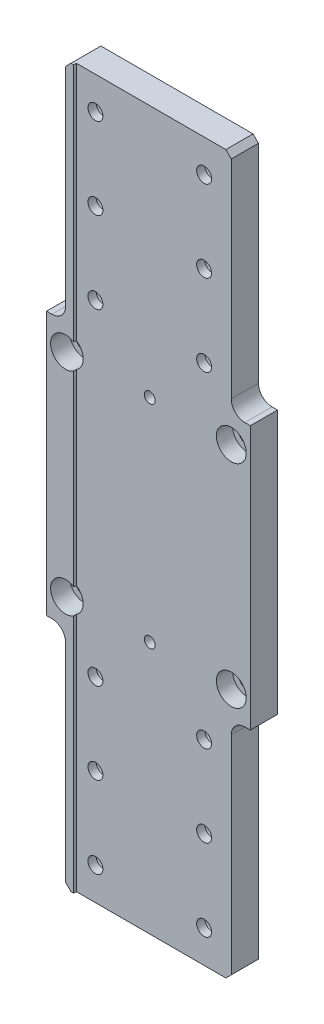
from build123d import *

# Parameters (mm, degrees)
SKETCH_1_W                   = 60
SKETCH_1_H                   = 264
SKETCH_1_W_2                 = 74
SKETCH_1_H_2                 = 97
EXTRUDE_1_DEPTH              = 11
SKETCH_2_W                   = 64
SKETCH_2_H                   = 264
CUT_EXTRUDE_1_DEPTH          = 1
HOLE_WIZARD_M6_1_D           = 6.6
HOLE_WIZARD_M6_1_CBORE_D     = 11
HOLE_WIZARD_M6_1_CBORE_DEPTH = 7
HOLE_WIZARD_M5_1_D           = 5.5
HOLE_WIZARD_M5_1_CBORE_D     = 9.5
HOLE_WIZARD_M5_1_CBORE_DEPTH = 7
PATTERN_LINEAR_1_COUNT       = 2
PATTERN_LINEAR_1_PITCH       = 180
F_4_0MM_1_D                  = 4
FILLET_1_R                   = 5
CHAMFER_1_SIZE               = 2


with BuildPart() as part:
    # Sketch 1 → Extrude 1 (new body)
    with BuildSketch(Plane.XY):
        Rectangle(SKETCH_1_W, SKETCH_1_H)
        Rectangle(SKETCH_1_W_2, SKETCH_1_H_2)
    extrude(amount=EXTRUDE_1_DEPTH)

    # Sketch 2 → Cut-Extrude 1 (cut)
    with BuildSketch(Plane.XY.offset(11)):
        with Locations((5, 0)):
            Rectangle(SKETCH_2_W, SKETCH_2_H)
    extrude(amount=-CUT_EXTRUDE_1_DEPTH, mode=Mode.SUBTRACT)

    # Hole Wizard M6 _ _ _ _ _1 (through all)
    with Locations(Plane.XY.offset(11)):
        with Locations((-30, 39), (30, 39), (-30, -39), (30, -39)):
            CounterBoreHole(HOLE_WIZARD_M6_1_D / 2, HOLE_WIZARD_M6_1_CBORE_D / 2, HOLE_WIZARD_M6_1_CBORE_DEPTH)

    # Hole Wizard M5 _ _ _ _ _1 (through all)
    with Locations(Plane(origin=(0, 0, 0), x_dir=(-1, 0, 0), z_dir=(0, 0, -1))):
        with Locations((-20, 120), (-20, 90), (20, 90), (-20, 60), (20, 60), (20, 120)):
            hole_wizard_m5_1 = CounterBoreHole(HOLE_WIZARD_M5_1_D / 2, HOLE_WIZARD_M5_1_CBORE_D / 2, HOLE_WIZARD_M5_1_CBORE_DEPTH)

    # Pattern Linear 1: Hole Wizard M5 _ _ _ _ _1 ×2
    with Locations(*[(0, -i * PATTERN_LINEAR_1_PITCH, 0) for i in range(1, PATTERN_LINEAR_1_COUNT)]):
        add(hole_wizard_m5_1, mode=Mode.SUBTRACT)

    # 4.0mm _ _1 (through all)
    with Locations(Plane(origin=(0, 0, 0), x_dir=(-1, 0, 0), z_dir=(0, 0, -1))):
        with Locations((0, 39), (0, -39)):
            Hole(F_4_0MM_1_D / 2)

    # Fillet 1
    fillet_1_edges = [part.edges().sort_by_distance(p)[0] for p in [
        (30, -48.5, 5),
        (30, 48.5, 5),
        (-30, -48.5, 5.5),
        (-30, 48.5, 5.5),
    ]]
    fillet(fillet_1_edges, radius=FILLET_1_R)

    # Chamfer 1
    chamfer_1_edges = [part.edges().sort_by_distance(p)[0] for p in [
        (30, 132, 5),
        (30, -132, 5),
        (-30, 132, 5.5),
        (-30, -132, 5.5),
    ]]
    chamfer(chamfer_1_edges, length=CHAMFER_1_SIZE)


solid = part.part
